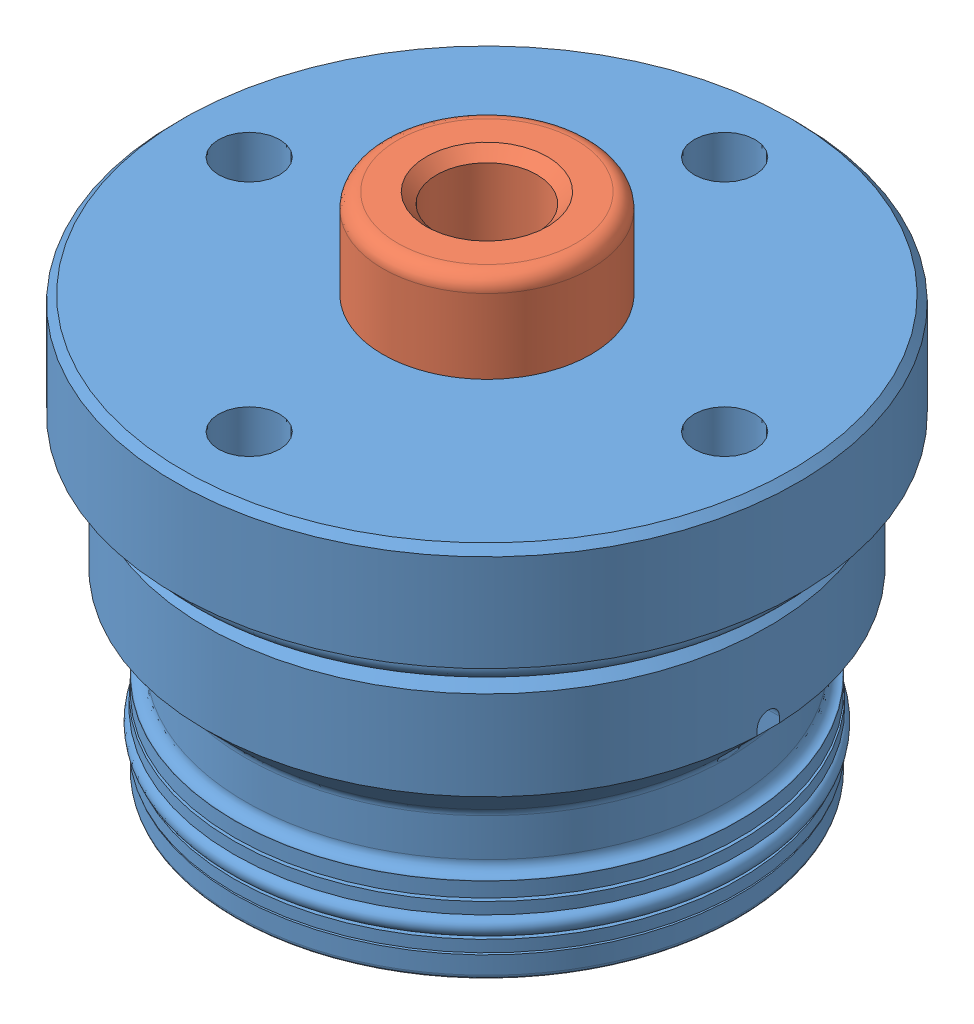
SolidWorks assembly ILC21021600.sldasm, configuration Default (file format 3400). Lengths in mm.
Overall size (66.55 53.96 66.55).
2 component instances, 2 part files, 3 mates.
Components (placement in the parent):
- ILC21021600_BODY-1: ILC21021600_BODY.sldprt [Default] at origin size (66.55 44.45 66.55)
- ILC21021600_PLUNGER-1: ILC21021600_PLUNGER.sldprt [Default] at (0 4.7625 0) x (0 1 0) z (0 0 1) size (49.2 44.45 44.45)
Mates (geometry in assembly coordinates):
- MID STROKE: distance = 4.7625 mm aligned: plane of ILC21021600_BODY-1 through (-26.9494 0 0) normal (0 -1 0); plane of ILC21021600_PLUNGER-1 through (-8.128 4.7625 0) normal (0 -1 0)
- Concentric1: concentric aligned: cylinder of ILC21021600_BODY-1; cylinder of ILC21021600_PLUNGER-1
- Coincident2: coincident aligned: unknown of ILC21021600_PLUNGER-1
